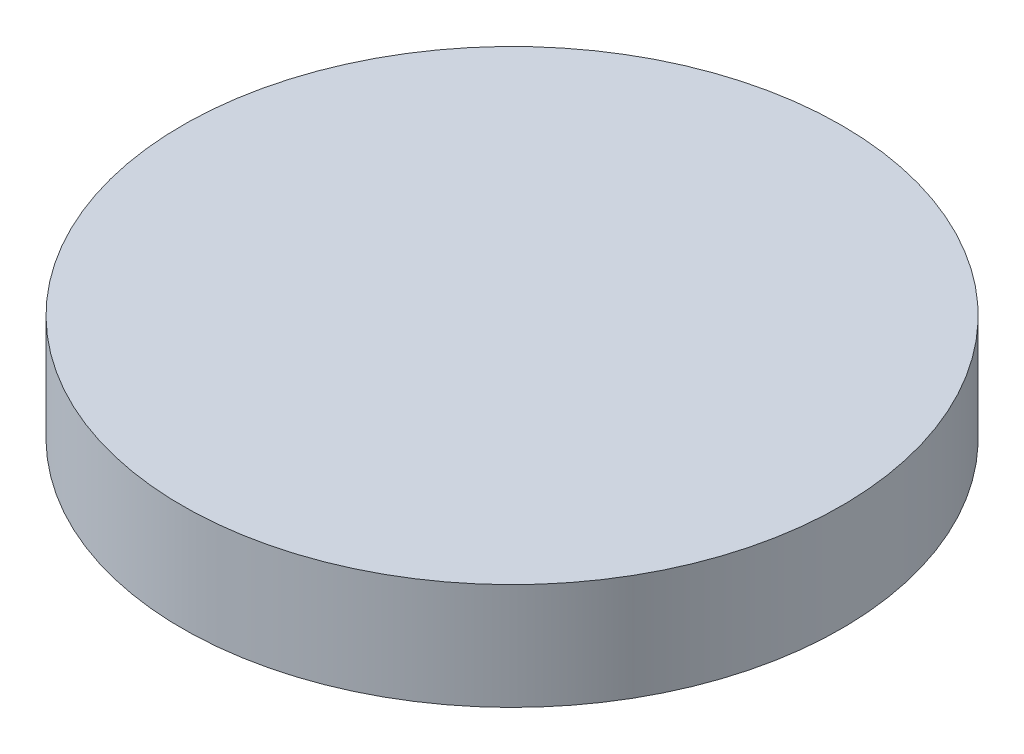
from build123d import *


with BuildPart() as part:
    # Sketch 1 → Revolve 1 (revolve)
    with BuildSketch(Plane.XY, mode=Mode.PRIVATE) as revolve_1_sk:
        Polygon((0, 635), (1100, 635), (1100, 280), (625, 0), (0, 0), align=None)
    revolve(revolve_1_sk.sketch.rotate(Axis((0, 0, 0), (0, 1, 0)), 90), axis=Axis((0, 0, 0), (0, 1, 0)))


solid = part.part
